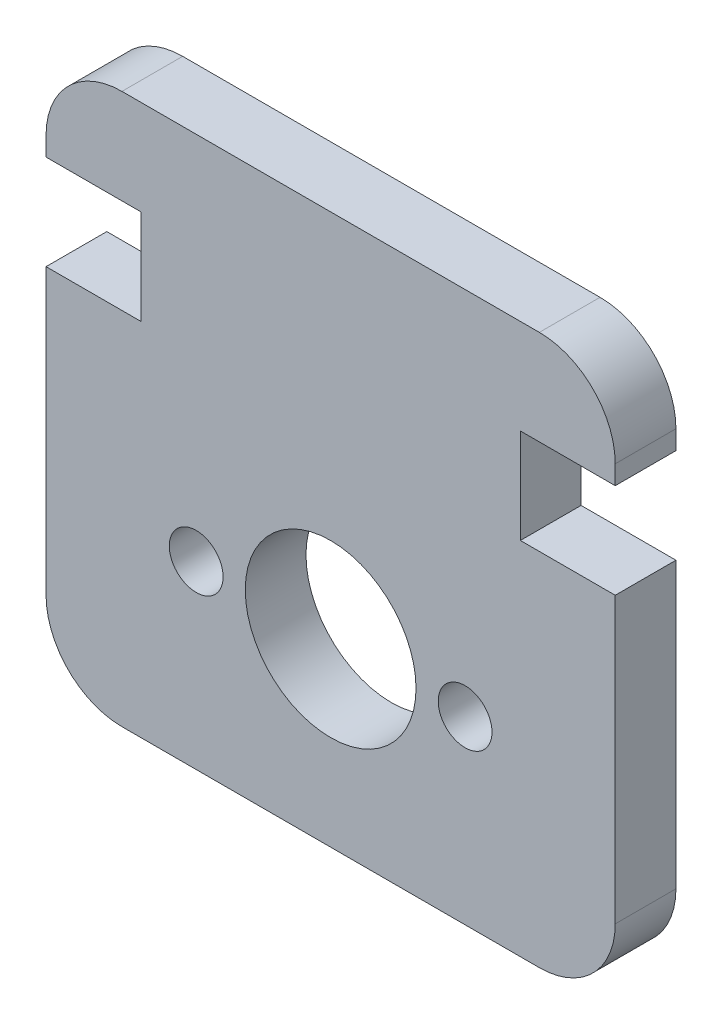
from build123d import *

# Parameters (mm, degrees)
SKETCH1_W                  = 19.05
SKETCH1_H                  = 15.24
BOSS_EXTRUDE1_DEPTH        = 1.016
SKETCH2_R                  = 2.8575
CUT_EXTRUDE1_DEPTH         = 13.366044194
SKETCH3_W                  = 3.175
SKETCH3_H                  = 3.175
CUT_EXTRUDE2_DEPTH         = 13.366044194
M1_6_CLEARANCE_HOLE1_D     = 1.8
M1_6_CLEARANCE_HOLE1_DEPTH = 2.032
M1_6_CLEARANCE_HOLE1_TIP   = 0.540774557
FILLET1_R                  = 2.54
SKETCH6_W                  = 19.05
SKETCH6_H                  = 3.175
BOSS_EXTRUDE2_DEPTH        = 2.032
FILLET2_R                  = 2.54


with BuildPart() as part:
    # Sketch1 → Boss-Extrude1 (new, symmetric)
    with BuildSketch(Plane.XY):
        Rectangle(SKETCH1_W, SKETCH1_H)
    extrude(amount=BOSS_EXTRUDE1_DEPTH, both=True)

    # Sketch2 → Cut-Extrude1 (cut, through all)
    with BuildSketch(Plane.XY.offset(1.016)):
        with Locations((0, -1.5875)):
            Circle(SKETCH2_R)
    extrude(amount=-CUT_EXTRUDE1_DEPTH, mode=Mode.SUBTRACT)

    # Sketch3 → Cut-Extrude2 (cut, through all)
    with BuildSketch(Plane.XY.offset(1.016)):
        with Locations((-7.9375, 6.0325)):
            Rectangle(SKETCH3_W, SKETCH3_H)
        with Locations((7.9375, 6.0325)):
            Rectangle(SKETCH3_W, SKETCH3_H)
    extrude(amount=-CUT_EXTRUDE2_DEPTH, mode=Mode.SUBTRACT)

    # M1.6 Clearance Hole1
    with Locations(Plane.XY.offset(1.016)):
        with Locations((-4.499999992, -1.5875), (4.500000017, -1.5875)):
            Hole(M1_6_CLEARANCE_HOLE1_D / 2, depth=M1_6_CLEARANCE_HOLE1_DEPTH)
            with Locations((0, 0, -(M1_6_CLEARANCE_HOLE1_DEPTH + M1_6_CLEARANCE_HOLE1_TIP / 2))):  # 118° drill point
                Cone(0, M1_6_CLEARANCE_HOLE1_D / 2, M1_6_CLEARANCE_HOLE1_TIP, mode=Mode.SUBTRACT)

    # Fillet1
    fillet1_edges = [part.edges().sort_by_distance(p)[0] for p in [
        (9.525, -7.62, 0),
        (-9.525, -7.62, 0),
    ]]
    fillet(fillet1_edges, radius=FILLET1_R)

    # Sketch6 → Boss-Extrude2 (add)
    with BuildSketch(Plane.XY.offset(1.016)):
        with Locations((0, 9.2075)):
            Rectangle(SKETCH6_W, SKETCH6_H)
    extrude(amount=-BOSS_EXTRUDE2_DEPTH)

    # Fillet2
    fillet2_edges = [part.edges().sort_by_distance(p)[0] for p in [
        (-9.525, 10.795, 0),
        (9.525, 10.795, 0),
    ]]
    fillet(fillet2_edges, radius=FILLET2_R)


solid = part.part
